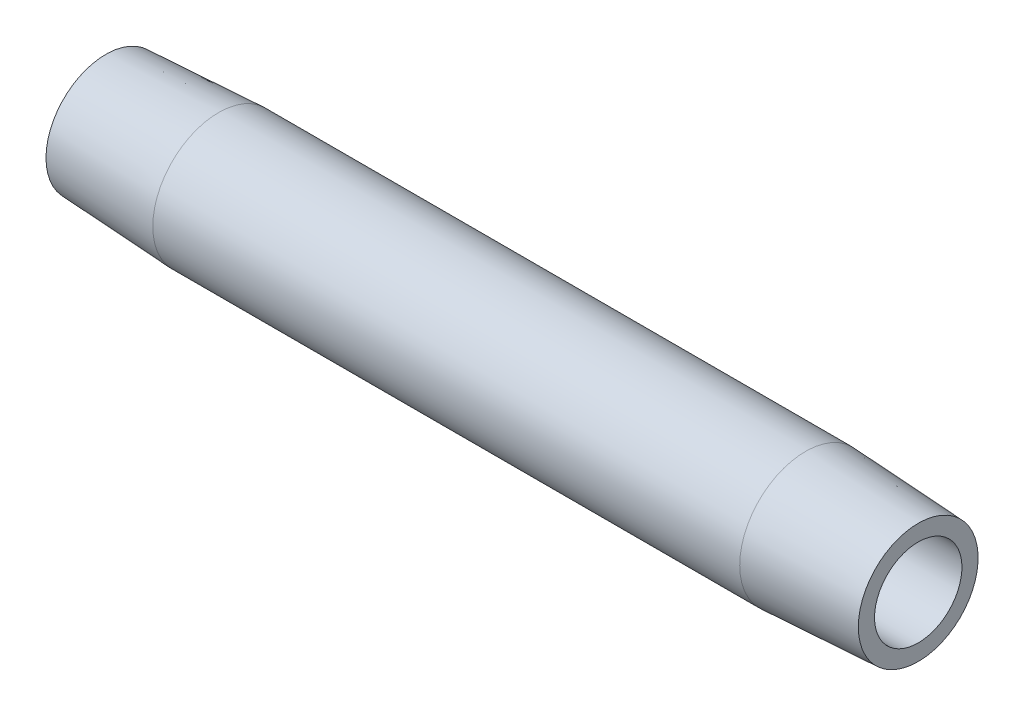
from build123d import *


with BuildPart() as part:
    # Sketch2 → Revolve1 (revolve)
    with BuildSketch(Plane.XY, mode=Mode.PRIVATE) as revolve1_sk:
        Polygon((8.810039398, 5.1435), (0, 4.6817854), (0, 3.4163), (63.5, 3.4163), (63.5, 4.6817854), (54.689960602, 5.1435), align=None)
    revolve(revolve1_sk.sketch.rotate(Axis((0.476141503, 0, 0), (1, 0, 0)), 90), axis=Axis((0.476141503, 0, 0), (1, 0, 0)))


solid = part.part
